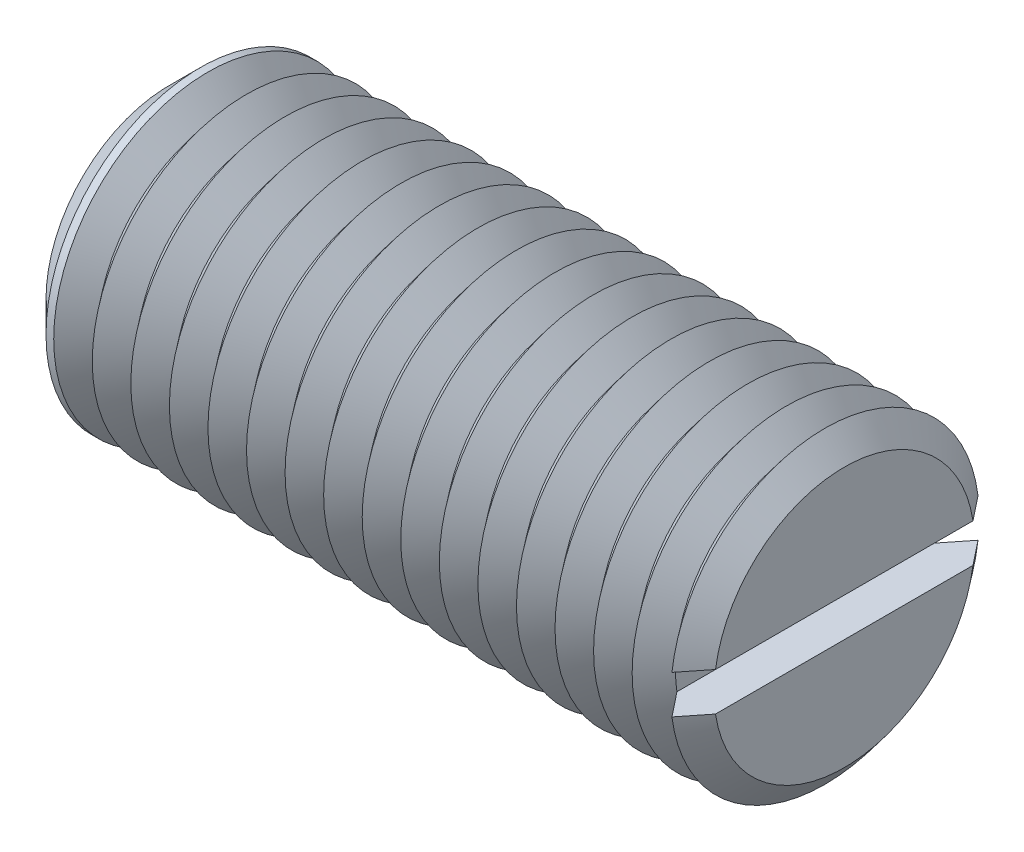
from build123d import *

# Parameters (mm, degrees)
SKETCH1_R       = 8
EXTRUDE1_DEPTH  = 17.5
SKETCH2_W       = 2
SKETCH2_H       = 2
EXTRUDE2_DEPTH  = 12
CHAMFER1_SIZE   = 1.6
LPATTERN1_COUNT = 17
LPATTERN1_PITCH = 2


with BuildPart() as part:
    # Sketch1 → Extrude1 (new, symmetric)
    with BuildSketch(Plane(origin=(0, 0, 0), x_dir=(0, 0, -1), z_dir=(1, 0, 0))):
        Circle(SKETCH1_R)
    extrude(amount=EXTRUDE1_DEPTH, both=True)

    # Sketch2 → Extrude2 (cut, symmetric)
    with BuildSketch(Plane.XY):
        with Locations((16.5, 0)):
            Rectangle(SKETCH2_W, SKETCH2_H)
    extrude(amount=EXTRUDE2_DEPTH, both=True, mode=Mode.SUBTRACT)

    # Chamfer1
    chamfer1_edges = [part.edges().sort_by_distance(p)[0] for p in [
        (-17.5, 0, 8),
    ]]
    chamfer(chamfer1_edges, length=CHAMFER1_SIZE)

    # Sketch3 → Cut-Revolve1 (revolve, cut)
    with BuildSketch(Plane.XY, mode=Mode.PRIVATE) as cut_revolve1_sk:
        Polygon((16.5, -8), (18.5, -8), (17.5, -6.7510004), align=None)
    cut_revolve1 = revolve(cut_revolve1_sk.sketch.rotate(Axis((0, 0, 0), (1, 0, 0)), 277.180755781), axis=Axis((0, 0, 0), (1, 0, 0)), mode=Mode.SUBTRACT)

    # LPattern1: Cut-Revolve1 ×17
    with Locations(*[(-i * LPATTERN1_PITCH, 0, 0) for i in range(1, LPATTERN1_COUNT)]):
        add(cut_revolve1, mode=Mode.SUBTRACT)


solid = part.part
